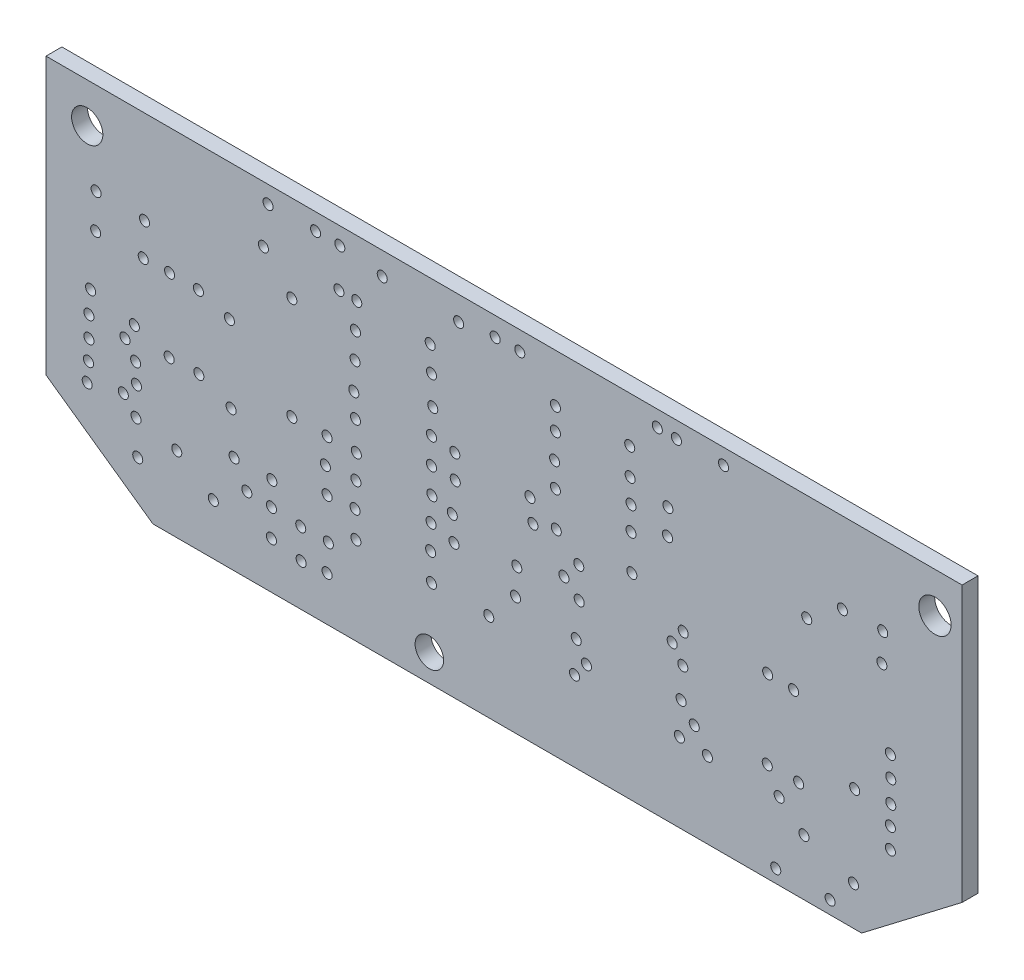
from build123d import *

# Parameters (mm, degrees)
ESQUISSE1_R      = 0.5
ESQUISSE1_R_2    = 1.41864895
ESQUISSE1_R_3    = 1.553593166
ESQUISSE1_R_4    = 1.606616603
EXTRUSION1_DEPTH = 1.58


with BuildPart() as part:
    # Esquisse1 → Extrusion1 (new body)
    with BuildSketch(Plane.XY):
        Polygon((-30.731225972, 13.557093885), (60.385726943, 13.557093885), (60.385726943, -13.786374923), (50.391568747, -21.422459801), (-20.099142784, -21.422459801), (-30.731225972, -13.913037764), align=None)
        with Locations((13.942232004, 11.672856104)):
            Circle(ESQUISSE1_R, mode=Mode.SUBTRACT)
        with Locations((16.391046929, 11.672856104)):
            Circle(ESQUISSE1_R, mode=Mode.SUBTRACT)
        with Locations((10.311230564, 11.16620474)):
            Circle(ESQUISSE1_R, mode=Mode.SUBTRACT)
        with Locations((2.711460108, 11.292867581)):
            Circle(ESQUISSE1_R, mode=Mode.SUBTRACT)
        with Locations((0.17820329, 7.915191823)):
            Circle(ESQUISSE1_R, mode=Mode.SUBTRACT)
        with Locations((-1.595076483, 7.95741277)):
            Circle(ESQUISSE1_R, mode=Mode.SUBTRACT)
        with Locations((0.051540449, 5.297493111)):
            Circle(ESQUISSE1_R, mode=Mode.SUBTRACT)
        with Locations((0.009319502, 2.722015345)):
            Circle(ESQUISSE1_R, mode=Mode.SUBTRACT)
        with Locations((7.482427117, 7.872970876)):
            Circle(ESQUISSE1_R, mode=Mode.SUBTRACT)
        with Locations((7.609089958, 5.381935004)):
            Circle(ESQUISSE1_R, mode=Mode.SUBTRACT)
        with Locations((7.735752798, 2.553131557)):
            Circle(ESQUISSE1_R, mode=Mode.SUBTRACT)
        with Locations((7.609089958, 0.019874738)):
            Circle(ESQUISSE1_R, mode=Mode.SUBTRACT)
        with Locations((7.609089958, -2.555603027)):
            Circle(ESQUISSE1_R, mode=Mode.SUBTRACT)
        with Locations((7.651310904, -5.088859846)):
            Circle(ESQUISSE1_R, mode=Mode.SUBTRACT)
        with Locations((7.566869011, -7.495453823)):
            Circle(ESQUISSE1_R, mode=Mode.SUBTRACT)
        with Locations((7.524648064, -9.944268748)):
            Circle(ESQUISSE1_R, mode=Mode.SUBTRACT)
        with Locations((9.931242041, -0.27567189)):
            Circle(ESQUISSE1_R, mode=Mode.SUBTRACT)
        with Locations((9.973462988, -2.640044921)):
            Circle(ESQUISSE1_R, mode=Mode.SUBTRACT)
        with Locations((9.677916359, -5.679953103)):
            Circle(ESQUISSE1_R, mode=Mode.SUBTRACT)
        with Locations((9.846800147, -8.086547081)):
            Circle(ESQUISSE1_R, mode=Mode.SUBTRACT)
        with Locations((17.404349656, -0.360113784)):
            Circle(ESQUISSE1_R, mode=Mode.SUBTRACT)
        with Locations((17.699896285, -2.51338208)):
            Circle(ESQUISSE1_R, mode=Mode.SUBTRACT)
        with Locations((19.937606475, 8.759610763)):
            Circle(ESQUISSE1_R, mode=Mode.SUBTRACT)
        with Locations((19.937606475, 6.56412152)):
            Circle(ESQUISSE1_R, mode=Mode.SUBTRACT)
        with Locations((19.853164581, 4.030864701)):
            Circle(ESQUISSE1_R, mode=Mode.SUBTRACT)
        with Locations((19.937606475, 1.624270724)):
            Circle(ESQUISSE1_R, mode=Mode.SUBTRACT)
        with Locations((20.022048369, -1.837846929)):
            Circle(ESQUISSE1_R, mode=Mode.SUBTRACT)
        with Locations((22.259758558, -3.780010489)):
            Circle(ESQUISSE1_R, mode=Mode.SUBTRACT)
        with Locations((20.782025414, -5.511069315)):
            Circle(ESQUISSE1_R, mode=Mode.SUBTRACT)
        with Locations((22.301979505, -6.819918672)):
            Circle(ESQUISSE1_R, mode=Mode.SUBTRACT)
        with Locations((16.0955003, -6.98880246)):
            Circle(ESQUISSE1_R, mode=Mode.SUBTRACT)
        with Locations((15.968837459, -9.648722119)):
            Circle(ESQUISSE1_R, mode=Mode.SUBTRACT)
        with Locations((22.006432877, -10.282036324)):
            Circle(ESQUISSE1_R, mode=Mode.SUBTRACT)
        with Locations((27.326272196, 9.012936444)):
            Circle(ESQUISSE1_R, mode=Mode.SUBTRACT)
        with Locations((27.368493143, 6.353016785)):
            Circle(ESQUISSE1_R, mode=Mode.SUBTRACT)
        with Locations((27.452935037, 4.030864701)):
            Circle(ESQUISSE1_R, mode=Mode.SUBTRACT)
        with Locations((27.452935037, 1.666491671)):
            Circle(ESQUISSE1_R, mode=Mode.SUBTRACT)
        with Locations((27.537376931, -1.837846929)):
            Circle(ESQUISSE1_R, mode=Mode.SUBTRACT)
        with Locations((31.126157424, 5.635260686)):
            Circle(ESQUISSE1_R, mode=Mode.SUBTRACT)
        with Locations((31.083936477, 3.102003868)):
            Circle(ESQUISSE1_R, mode=Mode.SUBTRACT)
        with Locations((32.646111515, -4.3288828)):
            Circle(ESQUISSE1_R, mode=Mode.SUBTRACT)
        with Locations((31.548366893, -5.806615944)):
            Circle(ESQUISSE1_R, mode=Mode.SUBTRACT)
        with Locations((32.603890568, -7.284349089)):
            Circle(ESQUISSE1_R, mode=Mode.SUBTRACT)
        with Locations((32.43500678, -10.324257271)):
            Circle(ESQUISSE1_R, mode=Mode.SUBTRACT)
        with Locations((7.609089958, -12.646409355)):
            Circle(ESQUISSE1_R, mode=Mode.SUBTRACT)
        with Locations(Location((7.397985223, -18.726225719, 0), (0, 0, 180))):
            Circle(ESQUISSE1_R_2, mode=Mode.SUBTRACT)
        with Locations((0.093761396, -12.688630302)):
            Circle(ESQUISSE1_R, mode=Mode.SUBTRACT)
        with Locations((0.009319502, -10.070931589)):
            Circle(ESQUISSE1_R, mode=Mode.SUBTRACT)
        with Locations((0.093761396, -7.579895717)):
            Circle(ESQUISSE1_R, mode=Mode.SUBTRACT)
        with Locations((-2.946146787, -7.791000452)):
            Circle(ESQUISSE1_R, mode=Mode.SUBTRACT)
        with Locations((-2.777262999, -10.282036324)):
            Circle(ESQUISSE1_R, mode=Mode.SUBTRACT)
        with Locations((-2.650600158, -14.293026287)):
            Circle(ESQUISSE1_R, mode=Mode.SUBTRACT)
        with Locations((-5.394961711, -14.293026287)):
            Circle(ESQUISSE1_R, mode=Mode.SUBTRACT)
        with Locations((-8.308207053, -14.081921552)):
            Circle(ESQUISSE1_R, mode=Mode.SUBTRACT)
        with Locations((-8.265986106, -11.717548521)):
            Circle(ESQUISSE1_R, mode=Mode.SUBTRACT)
        with Locations((-12.023650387, -11.675327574)):
            Circle(ESQUISSE1_R, mode=Mode.SUBTRACT)
        with Locations((-10.757021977, -13.955258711)):
            Circle(ESQUISSE1_R, mode=Mode.SUBTRACT)
        with Locations((-5.352740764, -17.248492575)):
            Circle(ESQUISSE1_R, mode=Mode.SUBTRACT)
        with Locations((-2.777262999, -16.995166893)):
            Circle(ESQUISSE1_R, mode=Mode.SUBTRACT)
        with Locations((-8.308207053, -16.784062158)):
            Circle(ESQUISSE1_R, mode=Mode.SUBTRACT)
        with Locations((-14.092476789, -16.361852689)):
            Circle(ESQUISSE1_R, mode=Mode.SUBTRACT)
        with Locations((-17.723478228, -13.913037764)):
            Circle(ESQUISSE1_R, mode=Mode.SUBTRACT)
        with Locations((-21.60780535, -16.446294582)):
            Circle(ESQUISSE1_R, mode=Mode.SUBTRACT)
        with Locations((-21.776689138, -13.110839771)):
            Circle(ESQUISSE1_R, mode=Mode.SUBTRACT)
        with Locations((-23.043317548, -11.633106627)):
            Circle(ESQUISSE1_R, mode=Mode.SUBTRACT)
        with Locations((-21.734468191, -10.239815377)):
            Circle(ESQUISSE1_R, mode=Mode.SUBTRACT)
        with Locations((-21.818910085, -8.297651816)):
            Circle(ESQUISSE1_R, mode=Mode.SUBTRACT)
        with Locations((-22.87443376, -6.819918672)):
            Circle(ESQUISSE1_R, mode=Mode.SUBTRACT)
        with Locations((-21.945572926, -5.215522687)):
            Circle(ESQUISSE1_R, mode=Mode.SUBTRACT)
        with Locations((-18.483455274, -6.271046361)):
            Circle(ESQUISSE1_R, mode=Mode.SUBTRACT)
        with Locations((-15.527988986, -6.228825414)):
            Circle(ESQUISSE1_R, mode=Mode.SUBTRACT)
        with Locations((-12.319197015, -7.579895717)):
            Circle(ESQUISSE1_R, mode=Mode.SUBTRACT)
        with Locations((-6.281601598, -5.299964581)):
            Circle(ESQUISSE1_R, mode=Mode.SUBTRACT)
        with Locations((-2.777262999, -5.215522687)):
            Circle(ESQUISSE1_R, mode=Mode.SUBTRACT)
        with Locations((0.135982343, -5.17330174)):
            Circle(ESQUISSE1_R, mode=Mode.SUBTRACT)
        with Locations((-12.488080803, 0.019874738)):
            Circle(ESQUISSE1_R, mode=Mode.SUBTRACT)
        with Locations((-15.570209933, 0.990956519)):
            Circle(ESQUISSE1_R, mode=Mode.SUBTRACT)
        with Locations((-18.441234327, 1.033177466)):
            Circle(ESQUISSE1_R, mode=Mode.SUBTRACT)
        with Locations((-21.05893304, 0.990956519)):
            Circle(ESQUISSE1_R, mode=Mode.SUBTRACT)
        with Locations((-20.932270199, 4.284190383)):
            Circle(ESQUISSE1_R, mode=Mode.SUBTRACT)
        with Locations((-25.745458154, 4.410853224)):
            Circle(ESQUISSE1_R, mode=Mode.SUBTRACT)
        with Locations((-25.787679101, 0.948735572)):
            Circle(ESQUISSE1_R, mode=Mode.SUBTRACT)
        with Locations((-6.281601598, 4.917504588)):
            Circle(ESQUISSE1_R, mode=Mode.SUBTRACT)
        with Locations((-9.110405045, 7.95741277)):
            Circle(ESQUISSE1_R, mode=Mode.SUBTRACT)
        with Locations((-26.294330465, -4.3288828)):
            Circle(ESQUISSE1_R, mode=Mode.SUBTRACT)
        with Locations((-26.463214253, -6.56659299)):
            Circle(ESQUISSE1_R, mode=Mode.SUBTRACT)
        with Locations((-26.463214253, -8.635419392)):
            Circle(ESQUISSE1_R, mode=Mode.SUBTRACT)
        with Locations((-26.5054352, -10.6198039)):
            Circle(ESQUISSE1_R, mode=Mode.SUBTRACT)
        with Locations((-26.632098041, -12.519746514)):
            Circle(ESQUISSE1_R, mode=Mode.SUBTRACT)
        with Locations(Location((-26.632098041, 9.604029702, 0), (0, 0, 180))):
            Circle(ESQUISSE1_R_3, mode=Mode.SUBTRACT)
        with Locations((0.051540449, -2.302277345)):
            Circle(ESQUISSE1_R, mode=Mode.SUBTRACT)
        with Locations((13.308917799, -12.646409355)):
            Circle(ESQUISSE1_R, mode=Mode.SUBTRACT)
        with Locations((21.837549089, -13.448607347)):
            Circle(ESQUISSE1_R, mode=Mode.SUBTRACT)
        with Locations((23.019735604, -11.970874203)):
            Circle(ESQUISSE1_R, mode=Mode.SUBTRACT)
        with Locations((33.743856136, -11.844211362)):
            Circle(ESQUISSE1_R, mode=Mode.SUBTRACT)
        with Locations((32.266122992, -13.575270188)):
            Circle(ESQUISSE1_R, mode=Mode.SUBTRACT)
        with Locations((35.052705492, -13.82859587)):
            Circle(ESQUISSE1_R, mode=Mode.SUBTRACT)
        with Locations((41.850277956, -20.119516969)):
            Circle(ESQUISSE1_R, mode=Mode.SUBTRACT)
        with Locations((47.254559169, -20.119516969)):
            Circle(ESQUISSE1_R, mode=Mode.SUBTRACT)
        with Locations((44.654481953, -15.85461415)):
            Circle(ESQUISSE1_R, mode=Mode.SUBTRACT)
        with Locations((42.188045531, -13.786374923)):
            Circle(ESQUISSE1_R, mode=Mode.SUBTRACT)
        with Locations((41.005859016, -11.59088568)):
            Circle(ESQUISSE1_R, mode=Mode.SUBTRACT)
        with Locations((44.130209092, -11.59088568)):
            Circle(ESQUISSE1_R, mode=Mode.SUBTRACT)
        with Locations((43.623557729, -3.864452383)):
            Circle(ESQUISSE1_R, mode=Mode.SUBTRACT)
        with Locations((41.048079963, -3.737789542)):
            Circle(ESQUISSE1_R, mode=Mode.SUBTRACT)
        with Locations((44.932407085, 2.975341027)):
            Circle(ESQUISSE1_R, mode=Mode.SUBTRACT)
        with Locations((48.478966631, 5.508597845)):
            Circle(ESQUISSE1_R, mode=Mode.SUBTRACT)
        with Locations((52.489956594, 5.635260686)):
            Circle(ESQUISSE1_R, mode=Mode.SUBTRACT)
        with Locations((52.4055147, 2.806457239)):
            Circle(ESQUISSE1_R, mode=Mode.SUBTRACT)
        with Locations((53.249933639, -4.582208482)):
            Circle(ESQUISSE1_R, mode=Mode.SUBTRACT)
        with Locations((53.292154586, -6.651034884)):
            Circle(ESQUISSE1_R, mode=Mode.SUBTRACT)
        with Locations((53.292154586, -8.846524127)):
            Circle(ESQUISSE1_R, mode=Mode.SUBTRACT)
        with Locations((53.249933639, -10.788687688)):
            Circle(ESQUISSE1_R, mode=Mode.SUBTRACT)
        with Locations((53.249933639, -12.815293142)):
            Circle(ESQUISSE1_R, mode=Mode.SUBTRACT)
        with Locations((49.703374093, -9.35317549)):
            Circle(ESQUISSE1_R, mode=Mode.SUBTRACT)
        with Locations((49.576711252, -17.544039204)):
            Circle(ESQUISSE1_R, mode=Mode.SUBTRACT)
        with Locations((30.070633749, 11.968402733)):
            Circle(ESQUISSE1_R, mode=Mode.SUBTRACT)
        with Locations((31.970576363, 11.926181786)):
            Circle(ESQUISSE1_R, mode=Mode.SUBTRACT)
        with Locations((36.657101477, 12.01062368)):
            Circle(ESQUISSE1_R, mode=Mode.SUBTRACT)
        with Locations((-1.510634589, 11.841739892)):
            Circle(ESQUISSE1_R, mode=Mode.SUBTRACT)
        with Locations((-3.917228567, 11.883960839)):
            Circle(ESQUISSE1_R, mode=Mode.SUBTRACT)
        with Locations((-8.645974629, 11.841739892)):
            Circle(ESQUISSE1_R, mode=Mode.SUBTRACT)
        with Locations((-0.117343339, -0.022346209)):
            Circle(ESQUISSE1_R, mode=Mode.SUBTRACT)
        with Locations(Location((57.683133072, 9.561808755, 0), (0, 0, 180))):
            Circle(ESQUISSE1_R_4, mode=Mode.SUBTRACT)
    extrude(amount=EXTRUSION1_DEPTH)


solid = part.part
